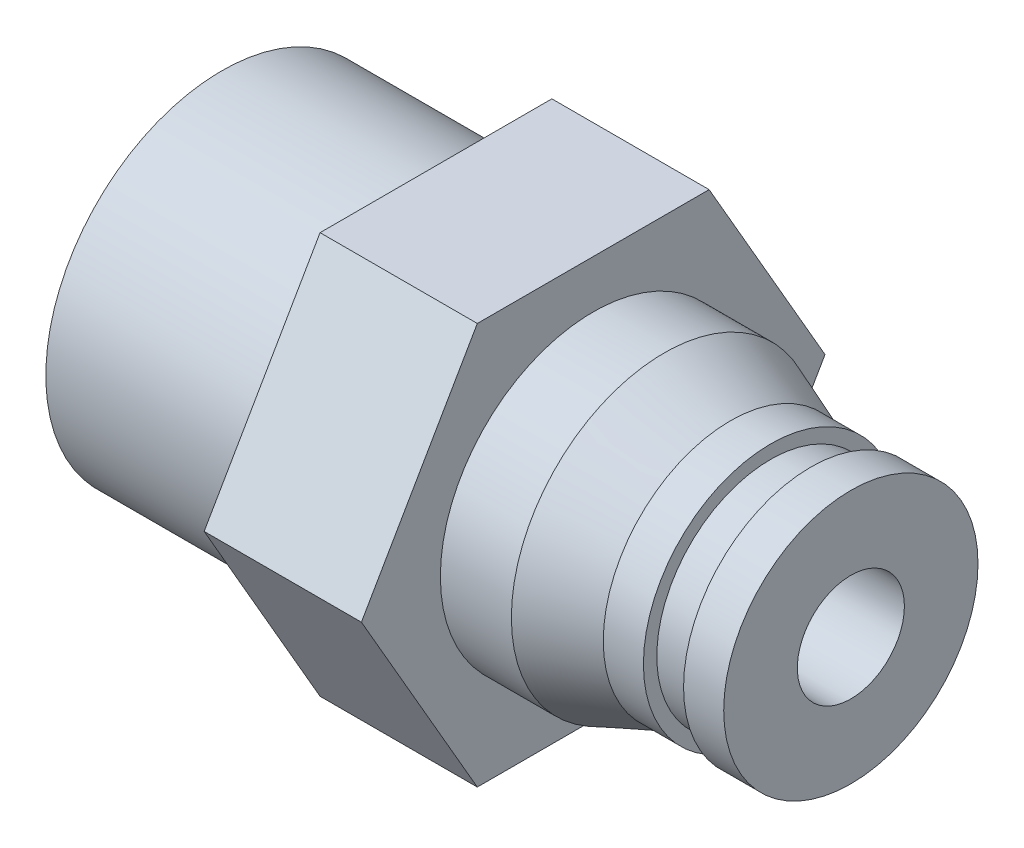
ISO-10303-21;
HEADER;
FILE_DESCRIPTION(('STEP AP214'),'2;1');
FILE_NAME('part.step','',(''),(''),'','','');
FILE_SCHEMA(('AUTOMOTIVE_DESIGN { 1 0 10303 214 1 1 1 1 }'));
ENDSEC;
DATA;
#1=APPLICATION_CONTEXT('core data for automotive mechanical design processes');
#2=APPLICATION_PROTOCOL_DEFINITION('international standard','automotive_design',2000,#1);
#3=PRODUCT_CONTEXT('',#1,'mechanical');
#4=PRODUCT('Part','Part','',(#3));
#5=PRODUCT_RELATED_PRODUCT_CATEGORY('part','',(#4));
#6=PRODUCT_DEFINITION_FORMATION('','',#4);
#7=PRODUCT_DEFINITION_CONTEXT('part definition',#1,'design');
#8=PRODUCT_DEFINITION('design','',#6,#7);
#9=PRODUCT_DEFINITION_SHAPE('','',#8);
#10=(LENGTH_UNIT() NAMED_UNIT(*) SI_UNIT(.MILLI.,.METRE.));
#11=(NAMED_UNIT(*) PLANE_ANGLE_UNIT() SI_UNIT($,.RADIAN.));
#12=(NAMED_UNIT(*) SI_UNIT($,.STERADIAN.) SOLID_ANGLE_UNIT());
#13=UNCERTAINTY_MEASURE_WITH_UNIT(LENGTH_MEASURE(1.E-05),#10,'distance_accuracy_value','');
#14=(GEOMETRIC_REPRESENTATION_CONTEXT(3) GLOBAL_UNCERTAINTY_ASSIGNED_CONTEXT((#13)) GLOBAL_UNIT_ASSIGNED_CONTEXT((#10,
#11,#12)) REPRESENTATION_CONTEXT('',''));
#15=CARTESIAN_POINT('',(0.,0.,0.));
#16=DIRECTION('',(0.,0.,1.));
#17=DIRECTION('',(1.,0.,0.));
#18=AXIS2_PLACEMENT_3D('',#15,#16,#17);
#19=CARTESIAN_POINT('',(8.,6.575,0.));
#20=DIRECTION('',(-1.,0.,0.));
#21=DIRECTION('',(0.,0.,1.));
#22=AXIS2_PLACEMENT_3D('',#19,#20,#21);
#23=PLANE('',#22);
#24=CARTESIAN_POINT('',(8.,0.,0.));
#25=DIRECTION('',(1.,0.,0.));
#26=DIRECTION('',(0.,0.,-1.));
#27=AXIS2_PLACEMENT_3D('',#24,#25,#26);
#28=CIRCLE('',#27,6.575);
#29=CARTESIAN_POINT('',(8.,0.,-6.575));
#30=VERTEX_POINT('',#29);
#31=EDGE_CURVE('E215',#30,#30,#28,.T.);
#32=ORIENTED_EDGE('',*,*,#31,.T.);
#33=EDGE_LOOP('',(#32));
#34=FACE_BOUND('',#33,.T.);
#35=DIRECTION('',(0.,-0.866025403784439,0.5));
#36=VECTOR('',#35,1.);
#37=CARTESIAN_POINT('',(8.,0.,-8.66025403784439));
#38=LINE('',#37,#36);
#39=CARTESIAN_POINT('',(8.,0.,-8.66025403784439));
#40=VERTEX_POINT('',#39);
#41=CARTESIAN_POINT('',(8.,-7.5,-4.33012701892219));
#42=VERTEX_POINT('',#41);
#43=EDGE_CURVE('E121',#40,#42,#38,.T.);
#44=ORIENTED_EDGE('',*,*,#43,.T.);
#45=DIRECTION('',(0.,0.,1.));
#46=VECTOR('',#45,1.);
#47=CARTESIAN_POINT('',(8.,-7.5,-4.33012701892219));
#48=LINE('',#47,#46);
#49=CARTESIAN_POINT('',(8.,-7.5,4.3301270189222));
#50=VERTEX_POINT('',#49);
#51=EDGE_CURVE('E106',#42,#50,#48,.T.);
#52=ORIENTED_EDGE('',*,*,#51,.T.);
#53=DIRECTION('',(0.,0.866025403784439,0.5));
#54=VECTOR('',#53,1.);
#55=CARTESIAN_POINT('',(8.,-7.5,4.3301270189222));
#56=LINE('',#55,#54);
#57=CARTESIAN_POINT('',(8.,0.,8.66025403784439));
#58=VERTEX_POINT('',#57);
#59=EDGE_CURVE('E115',#50,#58,#56,.T.);
#60=ORIENTED_EDGE('',*,*,#59,.T.);
#61=DIRECTION('',(0.,0.866025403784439,-0.5));
#62=VECTOR('',#61,1.);
#63=CARTESIAN_POINT('',(8.,0.,8.66025403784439));
#64=LINE('',#63,#62);
#65=CARTESIAN_POINT('',(8.,7.5,4.33012701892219));
#66=VERTEX_POINT('',#65);
#67=EDGE_CURVE('E30',#58,#66,#64,.T.);
#68=ORIENTED_EDGE('',*,*,#67,.T.);
#69=DIRECTION('',(0.,0.,-1.));
#70=VECTOR('',#69,1.);
#71=CARTESIAN_POINT('',(8.,7.5,4.33012701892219));
#72=LINE('',#71,#70);
#73=CARTESIAN_POINT('',(8.,7.5,-4.3301270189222));
#74=VERTEX_POINT('',#73);
#75=EDGE_CURVE('E125',#66,#74,#72,.T.);
#76=ORIENTED_EDGE('',*,*,#75,.T.);
#77=DIRECTION('',(0.,-0.866025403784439,-0.5));
#78=VECTOR('',#77,1.);
#79=CARTESIAN_POINT('',(8.,7.5,-4.3301270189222));
#80=LINE('',#79,#78);
#81=EDGE_CURVE('E128',#74,#40,#80,.T.);
#82=ORIENTED_EDGE('',*,*,#81,.T.);
#83=EDGE_LOOP('',(#44,#52,#60,#68,#76,#82));
#84=FACE_BOUND('',#83,.T.);
#85=ADVANCED_FACE('F15',(#34,#84),#23,.T.);
#86=CARTESIAN_POINT('',(13.875,9.5,0.));
#87=DIRECTION('',(1.,0.,0.));
#88=DIRECTION('',(0.,0.,-1.));
#89=AXIS2_PLACEMENT_3D('',#86,#87,#88);
#90=PLANE('',#89);
#91=CARTESIAN_POINT('',(13.875,0.,0.));
#92=DIRECTION('',(1.,0.,0.));
#93=DIRECTION('',(0.,0.,-1.));
#94=AXIS2_PLACEMENT_3D('',#91,#92,#93);
#95=CIRCLE('',#94,5.71042834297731);
#96=CARTESIAN_POINT('',(13.875,0.,-5.71042834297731));
#97=VERTEX_POINT('',#96);
#98=EDGE_CURVE('E212',#97,#97,#95,.T.);
#99=ORIENTED_EDGE('',*,*,#98,.F.);
#100=EDGE_LOOP('',(#99));
#101=FACE_BOUND('',#100,.T.);
#102=DIRECTION('',(0.,0.866025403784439,0.5));
#103=VECTOR('',#102,1.);
#104=CARTESIAN_POINT('',(13.875,-7.5,4.3301270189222));
#105=LINE('',#104,#103);
#106=CARTESIAN_POINT('',(13.875,-7.5,4.33012701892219));
#107=VERTEX_POINT('',#106);
#108=CARTESIAN_POINT('',(13.875,0.,8.66025403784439));
#109=VERTEX_POINT('',#108);
#110=EDGE_CURVE('E132',#107,#109,#105,.T.);
#111=ORIENTED_EDGE('',*,*,#110,.F.);
#112=DIRECTION('',(0.,0.,1.));
#113=VECTOR('',#112,1.);
#114=CARTESIAN_POINT('',(13.875,-7.5,-4.33012701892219));
#115=LINE('',#114,#113);
#116=CARTESIAN_POINT('',(13.875,-7.5,-4.33012701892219));
#117=VERTEX_POINT('',#116);
#118=EDGE_CURVE('E38',#117,#107,#115,.T.);
#119=ORIENTED_EDGE('',*,*,#118,.F.);
#120=DIRECTION('',(0.,-0.866025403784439,0.5));
#121=VECTOR('',#120,1.);
#122=CARTESIAN_POINT('',(13.875,0.,-8.66025403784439));
#123=LINE('',#122,#121);
#124=CARTESIAN_POINT('',(13.875,0.,-8.66025403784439));
#125=VERTEX_POINT('',#124);
#126=EDGE_CURVE('E112',#125,#117,#123,.T.);
#127=ORIENTED_EDGE('',*,*,#126,.F.);
#128=DIRECTION('',(0.,-0.866025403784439,-0.5));
#129=VECTOR('',#128,1.);
#130=CARTESIAN_POINT('',(13.875,7.5,-4.3301270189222));
#131=LINE('',#130,#129);
#132=CARTESIAN_POINT('',(13.875,7.5,-4.3301270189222));
#133=VERTEX_POINT('',#132);
#134=EDGE_CURVE('E140',#133,#125,#131,.T.);
#135=ORIENTED_EDGE('',*,*,#134,.F.);
#136=DIRECTION('',(0.,0.,-1.));
#137=VECTOR('',#136,1.);
#138=CARTESIAN_POINT('',(13.875,7.5,4.33012701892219));
#139=LINE('',#138,#137);
#140=CARTESIAN_POINT('',(13.875,7.5,4.33012701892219));
#141=VERTEX_POINT('',#140);
#142=EDGE_CURVE('E137',#141,#133,#139,.T.);
#143=ORIENTED_EDGE('',*,*,#142,.F.);
#144=DIRECTION('',(0.,0.866025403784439,-0.5));
#145=VECTOR('',#144,1.);
#146=CARTESIAN_POINT('',(13.875,0.,8.66025403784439));
#147=LINE('',#146,#145);
#148=EDGE_CURVE('E134',#109,#141,#147,.T.);
#149=ORIENTED_EDGE('',*,*,#148,.F.);
#150=EDGE_LOOP('',(#111,#119,#127,#135,#143,#149));
#151=FACE_BOUND('',#150,.T.);
#152=ADVANCED_FACE('F269',(#101,#151),#90,.T.);
#153=CARTESIAN_POINT('',(0.,0.,0.));
#154=DIRECTION('',(-1.,0.,0.));
#155=DIRECTION('',(0.,0.,1.));
#156=AXIS2_PLACEMENT_3D('',#153,#154,#155);
#157=PLANE('',#156);
#158=CARTESIAN_POINT('',(0.,0.,0.));
#159=DIRECTION('',(1.,0.,0.));
#160=DIRECTION('',(0.,0.,-1.));
#161=AXIS2_PLACEMENT_3D('',#158,#159,#160);
#162=CIRCLE('',#161,6.575);
#163=CARTESIAN_POINT('',(0.,0.,-6.575));
#164=VERTEX_POINT('',#163);
#165=EDGE_CURVE('E218',#164,#164,#162,.T.);
#166=ORIENTED_EDGE('',*,*,#165,.F.);
#167=EDGE_LOOP('',(#166));
#168=FACE_BOUND('',#167,.T.);
#169=DIRECTION('',(0.,-0.866025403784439,-0.5));
#170=VECTOR('',#169,1.);
#171=CARTESIAN_POINT('',(0.,0.,1.73205080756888));
#172=LINE('',#171,#170);
#173=CARTESIAN_POINT('',(0.,0.,1.73205080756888));
#174=VERTEX_POINT('',#173);
#175=CARTESIAN_POINT('',(0.,-1.5,0.866025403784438));
#176=VERTEX_POINT('',#175);
#177=EDGE_CURVE('E169',#174,#176,#172,.T.);
#178=ORIENTED_EDGE('',*,*,#177,.T.);
#179=DIRECTION('',(0.,0.,-1.));
#180=VECTOR('',#179,1.);
#181=CARTESIAN_POINT('',(0.,-1.5,0.866025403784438));
#182=LINE('',#181,#180);
#183=CARTESIAN_POINT('',(0.,-1.5,-0.866025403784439));
#184=VERTEX_POINT('',#183);
#185=EDGE_CURVE('E147',#176,#184,#182,.T.);
#186=ORIENTED_EDGE('',*,*,#185,.T.);
#187=DIRECTION('',(0.,0.866025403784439,-0.5));
#188=VECTOR('',#187,1.);
#189=CARTESIAN_POINT('',(0.,-1.5,-0.866025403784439));
#190=LINE('',#189,#188);
#191=CARTESIAN_POINT('',(0.,0.,-1.73205080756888));
#192=VERTEX_POINT('',#191);
#193=EDGE_CURVE('E157',#184,#192,#190,.T.);
#194=ORIENTED_EDGE('',*,*,#193,.T.);
#195=DIRECTION('',(0.,0.866025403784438,0.5));
#196=VECTOR('',#195,1.);
#197=CARTESIAN_POINT('',(0.,0.,-1.73205080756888));
#198=LINE('',#197,#196);
#199=CARTESIAN_POINT('',(0.,1.5,-0.866025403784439));
#200=VERTEX_POINT('',#199);
#201=EDGE_CURVE('E160',#192,#200,#198,.T.);
#202=ORIENTED_EDGE('',*,*,#201,.T.);
#203=DIRECTION('',(0.,0.,1.));
#204=VECTOR('',#203,1.);
#205=CARTESIAN_POINT('',(0.,1.5,-0.866025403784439));
#206=LINE('',#205,#204);
#207=CARTESIAN_POINT('',(0.,1.5,0.866025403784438));
#208=VERTEX_POINT('',#207);
#209=EDGE_CURVE('E163',#200,#208,#206,.T.);
#210=ORIENTED_EDGE('',*,*,#209,.T.);
#211=DIRECTION('',(0.,-0.866025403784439,0.5));
#212=VECTOR('',#211,1.);
#213=CARTESIAN_POINT('',(0.,1.5,0.866025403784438));
#214=LINE('',#213,#212);
#215=EDGE_CURVE('E166',#208,#174,#214,.T.);
#216=ORIENTED_EDGE('',*,*,#215,.T.);
#217=EDGE_LOOP('',(#178,#186,#194,#202,#210,#216));
#218=FACE_BOUND('',#217,.T.);
#219=ADVANCED_FACE('F17',(#168,#218),#157,.T.);
#220=CARTESIAN_POINT('',(7.5,2.,0.));
#221=DIRECTION('',(1.,0.,0.));
#222=DIRECTION('',(0.,0.,-1.));
#223=AXIS2_PLACEMENT_3D('',#220,#221,#222);
#224=PLANE('',#223);
#225=CARTESIAN_POINT('',(7.5,0.,0.));
#226=DIRECTION('',(1.,0.,0.));
#227=DIRECTION('',(0.,0.,-1.));
#228=AXIS2_PLACEMENT_3D('',#225,#226,#227);
#229=CIRCLE('',#228,2.);
#230=CARTESIAN_POINT('',(7.5,0.,-2.));
#231=VERTEX_POINT('',#230);
#232=EDGE_CURVE('E185',#231,#231,#229,.T.);
#233=ORIENTED_EDGE('',*,*,#232,.T.);
#234=EDGE_LOOP('',(#233));
#235=FACE_BOUND('',#234,.T.);
#236=DIRECTION('',(0.,-0.866025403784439,0.5));
#237=VECTOR('',#236,1.);
#238=CARTESIAN_POINT('',(7.5,0.75,-2.1650635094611));
#239=LINE('',#238,#237);
#240=CARTESIAN_POINT('',(7.5,0.,-1.73205080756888));
#241=VERTEX_POINT('',#240);
#242=CARTESIAN_POINT('',(7.5,-1.5,-0.866025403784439));
#243=VERTEX_POINT('',#242);
#244=EDGE_CURVE('E23',#241,#243,#239,.T.);
#245=ORIENTED_EDGE('',*,*,#244,.T.);
#246=DIRECTION('',(0.,0.,1.));
#247=VECTOR('',#246,1.);
#248=CARTESIAN_POINT('',(7.5,-1.5,0.));
#249=LINE('',#248,#247);
#250=CARTESIAN_POINT('',(7.5,-1.5,0.866025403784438));
#251=VERTEX_POINT('',#250);
#252=EDGE_CURVE('E10',#243,#251,#249,.T.);
#253=ORIENTED_EDGE('',*,*,#252,.T.);
#254=DIRECTION('',(0.,0.866025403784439,0.5));
#255=VECTOR('',#254,1.);
#256=CARTESIAN_POINT('',(7.5,0.75,2.1650635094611));
#257=LINE('',#256,#255);
#258=CARTESIAN_POINT('',(7.5,0.,1.73205080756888));
#259=VERTEX_POINT('',#258);
#260=EDGE_CURVE('E221',#251,#259,#257,.T.);
#261=ORIENTED_EDGE('',*,*,#260,.T.);
#262=DIRECTION('',(0.,0.866025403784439,-0.5));
#263=VECTOR('',#262,1.);
#264=CARTESIAN_POINT('',(7.5,2.25,0.433012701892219));
#265=LINE('',#264,#263);
#266=CARTESIAN_POINT('',(7.5,1.5,0.866025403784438));
#267=VERTEX_POINT('',#266);
#268=EDGE_CURVE('E224',#259,#267,#265,.T.);
#269=ORIENTED_EDGE('',*,*,#268,.T.);
#270=DIRECTION('',(0.,0.,-1.));
#271=VECTOR('',#270,1.);
#272=CARTESIAN_POINT('',(7.5,1.5,0.));
#273=LINE('',#272,#271);
#274=CARTESIAN_POINT('',(7.5,1.5,-0.866025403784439));
#275=VERTEX_POINT('',#274);
#276=EDGE_CURVE('E227',#267,#275,#273,.T.);
#277=ORIENTED_EDGE('',*,*,#276,.T.);
#278=DIRECTION('',(0.,-0.866025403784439,-0.5));
#279=VECTOR('',#278,1.);
#280=CARTESIAN_POINT('',(7.5,2.25,-0.433012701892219));
#281=LINE('',#280,#279);
#282=EDGE_CURVE('E230',#275,#241,#281,.T.);
#283=ORIENTED_EDGE('',*,*,#282,.T.);
#284=EDGE_LOOP('',(#245,#253,#261,#269,#277,#283));
#285=FACE_BOUND('',#284,.T.);
#286=ADVANCED_FACE('F234',(#235,#285),#224,.T.);
#287=CARTESIAN_POINT('',(0.,0.,0.));
#288=DIRECTION('',(1.,0.,0.));
#289=DIRECTION('',(0.,0.,-1.));
#290=AXIS2_PLACEMENT_3D('',#287,#288,#289);
#291=CYLINDRICAL_SURFACE('',#290,6.575);
#292=ORIENTED_EDGE('',*,*,#165,.T.);
#293=EDGE_LOOP('',(#292));
#294=FACE_BOUND('',#293,.T.);
#295=ORIENTED_EDGE('',*,*,#31,.F.);
#296=EDGE_LOOP('',(#295));
#297=FACE_BOUND('',#296,.T.);
#298=ADVANCED_FACE('F278',(#294,#297),#291,.T.);
#299=CARTESIAN_POINT('',(0.,0.,0.));
#300=DIRECTION('',(1.,0.,0.));
#301=DIRECTION('',(0.,0.,-1.));
#302=AXIS2_PLACEMENT_3D('',#299,#300,#301);
#303=CYLINDRICAL_SURFACE('',#302,5.71042834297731);
#304=ORIENTED_EDGE('',*,*,#98,.T.);
#305=EDGE_LOOP('',(#304));
#306=FACE_BOUND('',#305,.T.);
#307=CARTESIAN_POINT('',(16.527492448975,0.,0.));
#308=DIRECTION('',(1.,0.,0.));
#309=DIRECTION('',(0.,0.,-1.));
#310=AXIS2_PLACEMENT_3D('',#307,#308,#309);
#311=CIRCLE('',#310,5.71042834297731);
#312=CARTESIAN_POINT('',(16.527492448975,0.,-5.71042834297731));
#313=VERTEX_POINT('',#312);
#314=EDGE_CURVE('E209',#313,#313,#311,.T.);
#315=ORIENTED_EDGE('',*,*,#314,.F.);
#316=EDGE_LOOP('',(#315));
#317=FACE_BOUND('',#316,.T.);
#318=ADVANCED_FACE('F280',(#306,#317),#303,.T.);
#319=CARTESIAN_POINT('',(19.,0.,0.));
#320=DIRECTION('',(-1.,0.,0.));
#321=DIRECTION('',(0.,0.,1.));
#322=AXIS2_PLACEMENT_3D('',#319,#320,#321);
#323=CONICAL_SURFACE('',#322,4.75,0.370503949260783);
#324=ORIENTED_EDGE('',*,*,#314,.T.);
#325=EDGE_LOOP('',(#324));
#326=FACE_BOUND('',#325,.T.);
#327=CARTESIAN_POINT('',(19.,0.,0.));
#328=DIRECTION('',(1.,0.,0.));
#329=DIRECTION('',(0.,0.,-1.));
#330=AXIS2_PLACEMENT_3D('',#327,#328,#329);
#331=CIRCLE('',#330,4.75);
#332=CARTESIAN_POINT('',(19.,0.,-4.75));
#333=VERTEX_POINT('',#332);
#334=EDGE_CURVE('E206',#333,#333,#331,.T.);
#335=ORIENTED_EDGE('',*,*,#334,.F.);
#336=EDGE_LOOP('',(#335));
#337=FACE_BOUND('',#336,.T.);
#338=ADVANCED_FACE('F286',(#326,#337),#323,.T.);
#339=CARTESIAN_POINT('',(0.,0.,0.));
#340=DIRECTION('',(1.,0.,0.));
#341=DIRECTION('',(0.,0.,-1.));
#342=AXIS2_PLACEMENT_3D('',#339,#340,#341);
#343=CYLINDRICAL_SURFACE('',#342,4.75);
#344=ORIENTED_EDGE('',*,*,#334,.T.);
#345=EDGE_LOOP('',(#344));
#346=FACE_BOUND('',#345,.T.);
#347=CARTESIAN_POINT('',(20.5,0.,0.));
#348=DIRECTION('',(1.,0.,0.));
#349=DIRECTION('',(0.,0.,-1.));
#350=AXIS2_PLACEMENT_3D('',#347,#348,#349);
#351=CIRCLE('',#350,4.75);
#352=CARTESIAN_POINT('',(20.5,0.,-4.75));
#353=VERTEX_POINT('',#352);
#354=EDGE_CURVE('E203',#353,#353,#351,.T.);
#355=ORIENTED_EDGE('',*,*,#354,.F.);
#356=EDGE_LOOP('',(#355));
#357=FACE_BOUND('',#356,.T.);
#358=ADVANCED_FACE('F330',(#346,#357),#343,.T.);
#359=CARTESIAN_POINT('',(20.5,4.75,0.));
#360=DIRECTION('',(1.,0.,0.));
#361=DIRECTION('',(0.,0.,-1.));
#362=AXIS2_PLACEMENT_3D('',#359,#360,#361);
#363=PLANE('',#362);
#364=ORIENTED_EDGE('',*,*,#354,.T.);
#365=EDGE_LOOP('',(#364));
#366=FACE_BOUND('',#365,.T.);
#367=CARTESIAN_POINT('',(20.5,0.,0.));
#368=DIRECTION('',(1.,0.,0.));
#369=DIRECTION('',(0.,0.,-1.));
#370=AXIS2_PLACEMENT_3D('',#367,#368,#369);
#371=CIRCLE('',#370,4.25);
#372=CARTESIAN_POINT('',(20.5,0.,-4.25));
#373=VERTEX_POINT('',#372);
#374=EDGE_CURVE('E200',#373,#373,#371,.T.);
#375=ORIENTED_EDGE('',*,*,#374,.F.);
#376=EDGE_LOOP('',(#375));
#377=FACE_BOUND('',#376,.T.);
#378=ADVANCED_FACE('F340',(#366,#377),#363,.T.);
#379=CARTESIAN_POINT('',(0.,0.,0.));
#380=DIRECTION('',(1.,0.,0.));
#381=DIRECTION('',(0.,0.,-1.));
#382=AXIS2_PLACEMENT_3D('',#379,#380,#381);
#383=CYLINDRICAL_SURFACE('',#382,4.25);
#384=ORIENTED_EDGE('',*,*,#374,.T.);
#385=EDGE_LOOP('',(#384));
#386=FACE_BOUND('',#385,.T.);
#387=CARTESIAN_POINT('',(22.,0.,0.));
#388=DIRECTION('',(1.,0.,0.));
#389=DIRECTION('',(0.,0.,-1.));
#390=AXIS2_PLACEMENT_3D('',#387,#388,#389);
#391=CIRCLE('',#390,4.25);
#392=CARTESIAN_POINT('',(22.,0.,-4.25));
#393=VERTEX_POINT('',#392);
#394=EDGE_CURVE('E197',#393,#393,#391,.T.);
#395=ORIENTED_EDGE('',*,*,#394,.F.);
#396=EDGE_LOOP('',(#395));
#397=FACE_BOUND('',#396,.T.);
#398=ADVANCED_FACE('F350',(#386,#397),#383,.T.);
#399=CARTESIAN_POINT('',(22.,4.25,0.));
#400=DIRECTION('',(-1.,0.,0.));
#401=DIRECTION('',(0.,0.,1.));
#402=AXIS2_PLACEMENT_3D('',#399,#400,#401);
#403=PLANE('',#402);
#404=ORIENTED_EDGE('',*,*,#394,.T.);
#405=EDGE_LOOP('',(#404));
#406=FACE_BOUND('',#405,.T.);
#407=CARTESIAN_POINT('',(22.,0.,0.));
#408=DIRECTION('',(1.,0.,0.));
#409=DIRECTION('',(0.,0.,-1.));
#410=AXIS2_PLACEMENT_3D('',#407,#408,#409);
#411=CIRCLE('',#410,4.75);
#412=CARTESIAN_POINT('',(22.,0.,-4.75));
#413=VERTEX_POINT('',#412);
#414=EDGE_CURVE('E194',#413,#413,#411,.T.);
#415=ORIENTED_EDGE('',*,*,#414,.F.);
#416=EDGE_LOOP('',(#415));
#417=FACE_BOUND('',#416,.T.);
#418=ADVANCED_FACE('F361',(#406,#417),#403,.T.);
#419=CARTESIAN_POINT('',(0.,0.,0.));
#420=DIRECTION('',(1.,0.,0.));
#421=DIRECTION('',(0.,0.,-1.));
#422=AXIS2_PLACEMENT_3D('',#419,#420,#421);
#423=CYLINDRICAL_SURFACE('',#422,4.75);
#424=ORIENTED_EDGE('',*,*,#414,.T.);
#425=EDGE_LOOP('',(#424));
#426=FACE_BOUND('',#425,.T.);
#427=CARTESIAN_POINT('',(23.5,0.,0.));
#428=DIRECTION('',(1.,0.,0.));
#429=DIRECTION('',(0.,0.,-1.));
#430=AXIS2_PLACEMENT_3D('',#427,#428,#429);
#431=CIRCLE('',#430,4.75);
#432=CARTESIAN_POINT('',(23.5,0.,-4.75));
#433=VERTEX_POINT('',#432);
#434=EDGE_CURVE('E191',#433,#433,#431,.T.);
#435=ORIENTED_EDGE('',*,*,#434,.F.);
#436=EDGE_LOOP('',(#435));
#437=FACE_BOUND('',#436,.T.);
#438=ADVANCED_FACE('F374',(#426,#437),#423,.T.);
#439=CARTESIAN_POINT('',(23.5,4.75,0.));
#440=DIRECTION('',(1.,0.,0.));
#441=DIRECTION('',(0.,0.,-1.));
#442=AXIS2_PLACEMENT_3D('',#439,#440,#441);
#443=PLANE('',#442);
#444=ORIENTED_EDGE('',*,*,#434,.T.);
#445=EDGE_LOOP('',(#444));
#446=FACE_BOUND('',#445,.T.);
#447=CARTESIAN_POINT('',(23.5,0.,0.));
#448=DIRECTION('',(1.,0.,0.));
#449=DIRECTION('',(0.,0.,-1.));
#450=AXIS2_PLACEMENT_3D('',#447,#448,#449);
#451=CIRCLE('',#450,2.);
#452=CARTESIAN_POINT('',(23.5,0.,-2.));
#453=VERTEX_POINT('',#452);
#454=EDGE_CURVE('E188',#453,#453,#451,.T.);
#455=ORIENTED_EDGE('',*,*,#454,.F.);
#456=EDGE_LOOP('',(#455));
#457=FACE_BOUND('',#456,.T.);
#458=ADVANCED_FACE('F385',(#446,#457),#443,.T.);
#459=CARTESIAN_POINT('',(0.,0.,0.));
#460=DIRECTION('',(1.,0.,0.));
#461=DIRECTION('',(0.,0.,-1.));
#462=AXIS2_PLACEMENT_3D('',#459,#460,#461);
#463=CYLINDRICAL_SURFACE('',#462,2.);
#464=ORIENTED_EDGE('',*,*,#454,.T.);
#465=EDGE_LOOP('',(#464));
#466=FACE_BOUND('',#465,.T.);
#467=ORIENTED_EDGE('',*,*,#232,.F.);
#468=EDGE_LOOP('',(#467));
#469=FACE_BOUND('',#468,.T.);
#470=ADVANCED_FACE('F397',(#466,#469),#463,.F.);
#471=CARTESIAN_POINT('',(23.5,-1.5,0.866025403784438));
#472=DIRECTION('',(0.,1.,0.));
#473=DIRECTION('',(0.,0.,1.));
#474=AXIS2_PLACEMENT_3D('',#471,#472,#473);
#475=PLANE('',#474);
#476=DIRECTION('',(-1.,0.,0.));
#477=VECTOR('',#476,1.);
#478=CARTESIAN_POINT('',(23.5,-1.5,-0.866025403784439));
#479=LINE('',#478,#477);
#480=EDGE_CURVE('E183',#243,#184,#479,.T.);
#481=ORIENTED_EDGE('',*,*,#480,.T.);
#482=ORIENTED_EDGE('',*,*,#185,.F.);
#483=DIRECTION('',(-1.,0.,0.));
#484=VECTOR('',#483,1.);
#485=CARTESIAN_POINT('',(23.5,-1.5,0.866025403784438));
#486=LINE('',#485,#484);
#487=EDGE_CURVE('E172',#251,#176,#486,.T.);
#488=ORIENTED_EDGE('',*,*,#487,.F.);
#489=ORIENTED_EDGE('',*,*,#252,.F.);
#490=EDGE_LOOP('',(#481,#482,#488,#489));
#491=FACE_BOUND('',#490,.T.);
#492=ADVANCED_FACE('F249',(#491),#475,.T.);
#493=CARTESIAN_POINT('',(23.5,-1.5,-0.866025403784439));
#494=DIRECTION('',(0.,0.5,0.866025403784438));
#495=DIRECTION('',(0.,-0.866025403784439,0.5));
#496=AXIS2_PLACEMENT_3D('',#493,#494,#495);
#497=PLANE('',#496);
#498=DIRECTION('',(-1.,0.,0.));
#499=VECTOR('',#498,1.);
#500=CARTESIAN_POINT('',(23.5,0.,-1.73205080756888));
#501=LINE('',#500,#499);
#502=EDGE_CURVE('E181',#241,#192,#501,.T.);
#503=ORIENTED_EDGE('',*,*,#502,.T.);
#504=ORIENTED_EDGE('',*,*,#193,.F.);
#505=ORIENTED_EDGE('',*,*,#480,.F.);
#506=ORIENTED_EDGE('',*,*,#244,.F.);
#507=EDGE_LOOP('',(#503,#504,#505,#506));
#508=FACE_BOUND('',#507,.T.);
#509=ADVANCED_FACE('F238',(#508),#497,.T.);
#510=CARTESIAN_POINT('',(23.5,0.,-1.73205080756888));
#511=DIRECTION('',(0.,-0.5,0.866025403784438));
#512=DIRECTION('',(0.,-0.866025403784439,-0.5));
#513=AXIS2_PLACEMENT_3D('',#510,#511,#512);
#514=PLANE('',#513);
#515=DIRECTION('',(-1.,0.,0.));
#516=VECTOR('',#515,1.);
#517=CARTESIAN_POINT('',(23.5,1.5,-0.866025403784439));
#518=LINE('',#517,#516);
#519=EDGE_CURVE('E179',#275,#200,#518,.T.);
#520=ORIENTED_EDGE('',*,*,#519,.T.);
#521=ORIENTED_EDGE('',*,*,#201,.F.);
#522=ORIENTED_EDGE('',*,*,#502,.F.);
#523=ORIENTED_EDGE('',*,*,#282,.F.);
#524=EDGE_LOOP('',(#520,#521,#522,#523));
#525=FACE_BOUND('',#524,.T.);
#526=ADVANCED_FACE('F242',(#525),#514,.T.);
#527=CARTESIAN_POINT('',(23.5,1.5,-0.866025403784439));
#528=DIRECTION('',(0.,-1.,0.));
#529=DIRECTION('',(0.,0.,-1.));
#530=AXIS2_PLACEMENT_3D('',#527,#528,#529);
#531=PLANE('',#530);
#532=DIRECTION('',(-1.,0.,0.));
#533=VECTOR('',#532,1.);
#534=CARTESIAN_POINT('',(23.5,1.5,0.866025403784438));
#535=LINE('',#534,#533);
#536=EDGE_CURVE('E177',#267,#208,#535,.T.);
#537=ORIENTED_EDGE('',*,*,#536,.T.);
#538=ORIENTED_EDGE('',*,*,#209,.F.);
#539=ORIENTED_EDGE('',*,*,#519,.F.);
#540=ORIENTED_EDGE('',*,*,#276,.F.);
#541=EDGE_LOOP('',(#537,#538,#539,#540));
#542=FACE_BOUND('',#541,.T.);
#543=ADVANCED_FACE('F258',(#542),#531,.T.);
#544=CARTESIAN_POINT('',(23.5,1.5,0.866025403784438));
#545=DIRECTION('',(0.,-0.5,-0.866025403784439));
#546=DIRECTION('',(0.,0.866025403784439,-0.5));
#547=AXIS2_PLACEMENT_3D('',#544,#545,#546);
#548=PLANE('',#547);
#549=DIRECTION('',(-1.,0.,0.));
#550=VECTOR('',#549,1.);
#551=CARTESIAN_POINT('',(23.5,0.,1.73205080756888));
#552=LINE('',#551,#550);
#553=EDGE_CURVE('E175',#259,#174,#552,.T.);
#554=ORIENTED_EDGE('',*,*,#553,.T.);
#555=ORIENTED_EDGE('',*,*,#215,.F.);
#556=ORIENTED_EDGE('',*,*,#536,.F.);
#557=ORIENTED_EDGE('',*,*,#268,.F.);
#558=EDGE_LOOP('',(#554,#555,#556,#557));
#559=FACE_BOUND('',#558,.T.);
#560=ADVANCED_FACE('F255',(#559),#548,.T.);
#561=CARTESIAN_POINT('',(23.5,0.,1.73205080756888));
#562=DIRECTION('',(0.,0.5,-0.866025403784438));
#563=DIRECTION('',(0.,0.866025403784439,0.5));
#564=AXIS2_PLACEMENT_3D('',#561,#562,#563);
#565=PLANE('',#564);
#566=ORIENTED_EDGE('',*,*,#487,.T.);
#567=ORIENTED_EDGE('',*,*,#177,.F.);
#568=ORIENTED_EDGE('',*,*,#553,.F.);
#569=ORIENTED_EDGE('',*,*,#260,.F.);
#570=EDGE_LOOP('',(#566,#567,#568,#569));
#571=FACE_BOUND('',#570,.T.);
#572=ADVANCED_FACE('F251',(#571),#565,.T.);
#573=CARTESIAN_POINT('',(13.875,-7.5,-4.33012701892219));
#574=DIRECTION('',(0.,-1.,0.));
#575=DIRECTION('',(0.,0.,-1.));
#576=AXIS2_PLACEMENT_3D('',#573,#574,#575);
#577=PLANE('',#576);
#578=DIRECTION('',(-1.,0.,0.));
#579=VECTOR('',#578,1.);
#580=CARTESIAN_POINT('',(13.875,-7.5,-4.33012701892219));
#581=LINE('',#580,#579);
#582=EDGE_CURVE('E145',#117,#42,#581,.T.);
#583=ORIENTED_EDGE('',*,*,#582,.F.);
#584=ORIENTED_EDGE('',*,*,#118,.T.);
#585=DIRECTION('',(-1.,0.,0.));
#586=VECTOR('',#585,1.);
#587=CARTESIAN_POINT('',(13.875,-7.5,4.3301270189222));
#588=LINE('',#587,#586);
#589=EDGE_CURVE('E102',#107,#50,#588,.T.);
#590=ORIENTED_EDGE('',*,*,#589,.T.);
#591=ORIENTED_EDGE('',*,*,#51,.F.);
#592=EDGE_LOOP('',(#583,#584,#590,#591));
#593=FACE_BOUND('',#592,.T.);
#594=ADVANCED_FACE('F104',(#593),#577,.T.);
#595=CARTESIAN_POINT('',(13.875,0.,-8.66025403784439));
#596=DIRECTION('',(0.,-0.5,-0.866025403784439));
#597=DIRECTION('',(0.,0.866025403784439,-0.5));
#598=AXIS2_PLACEMENT_3D('',#595,#596,#597);
#599=PLANE('',#598);
#600=DIRECTION('',(-1.,0.,0.));
#601=VECTOR('',#600,1.);
#602=CARTESIAN_POINT('',(13.875,0.,-8.66025403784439));
#603=LINE('',#602,#601);
#604=EDGE_CURVE('E148',#125,#40,#603,.T.);
#605=ORIENTED_EDGE('',*,*,#604,.F.);
#606=ORIENTED_EDGE('',*,*,#126,.T.);
#607=ORIENTED_EDGE('',*,*,#582,.T.);
#608=ORIENTED_EDGE('',*,*,#43,.F.);
#609=EDGE_LOOP('',(#605,#606,#607,#608));
#610=FACE_BOUND('',#609,.T.);
#611=ADVANCED_FACE('F458',(#610),#599,.T.);
#612=CARTESIAN_POINT('',(13.875,7.5,-4.3301270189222));
#613=DIRECTION('',(0.,0.5,-0.866025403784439));
#614=DIRECTION('',(0.,0.866025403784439,0.5));
#615=AXIS2_PLACEMENT_3D('',#612,#613,#614);
#616=PLANE('',#615);
#617=DIRECTION('',(-1.,0.,0.));
#618=VECTOR('',#617,1.);
#619=CARTESIAN_POINT('',(13.875,7.5,-4.3301270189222));
#620=LINE('',#619,#618);
#621=EDGE_CURVE('E150',#133,#74,#620,.T.);
#622=ORIENTED_EDGE('',*,*,#621,.F.);
#623=ORIENTED_EDGE('',*,*,#134,.T.);
#624=ORIENTED_EDGE('',*,*,#604,.T.);
#625=ORIENTED_EDGE('',*,*,#81,.F.);
#626=EDGE_LOOP('',(#622,#623,#624,#625));
#627=FACE_BOUND('',#626,.T.);
#628=ADVANCED_FACE('F467',(#627),#616,.T.);
#629=CARTESIAN_POINT('',(13.875,7.5,4.33012701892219));
#630=DIRECTION('',(0.,1.,0.));
#631=DIRECTION('',(0.,0.,1.));
#632=AXIS2_PLACEMENT_3D('',#629,#630,#631);
#633=PLANE('',#632);
#634=DIRECTION('',(-1.,0.,0.));
#635=VECTOR('',#634,1.);
#636=CARTESIAN_POINT('',(13.875,7.5,4.33012701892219));
#637=LINE('',#636,#635);
#638=EDGE_CURVE('E152',#141,#66,#637,.T.);
#639=ORIENTED_EDGE('',*,*,#638,.F.);
#640=ORIENTED_EDGE('',*,*,#142,.T.);
#641=ORIENTED_EDGE('',*,*,#621,.T.);
#642=ORIENTED_EDGE('',*,*,#75,.F.);
#643=EDGE_LOOP('',(#639,#640,#641,#642));
#644=FACE_BOUND('',#643,.T.);
#645=ADVANCED_FACE('F477',(#644),#633,.T.);
#646=CARTESIAN_POINT('',(13.875,0.,8.66025403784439));
#647=DIRECTION('',(0.,0.5,0.866025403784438));
#648=DIRECTION('',(0.,-0.866025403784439,0.5));
#649=AXIS2_PLACEMENT_3D('',#646,#647,#648);
#650=PLANE('',#649);
#651=DIRECTION('',(-1.,0.,0.));
#652=VECTOR('',#651,1.);
#653=CARTESIAN_POINT('',(13.875,0.,8.66025403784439));
#654=LINE('',#653,#652);
#655=EDGE_CURVE('E111',#109,#58,#654,.T.);
#656=ORIENTED_EDGE('',*,*,#655,.F.);
#657=ORIENTED_EDGE('',*,*,#148,.T.);
#658=ORIENTED_EDGE('',*,*,#638,.T.);
#659=ORIENTED_EDGE('',*,*,#67,.F.);
#660=EDGE_LOOP('',(#656,#657,#658,#659));
#661=FACE_BOUND('',#660,.T.);
#662=ADVANCED_FACE('F487',(#661),#650,.T.);
#663=CARTESIAN_POINT('',(13.875,-7.5,4.3301270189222));
#664=DIRECTION('',(0.,-0.5,0.866025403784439));
#665=DIRECTION('',(0.,-0.866025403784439,-0.5));
#666=AXIS2_PLACEMENT_3D('',#663,#664,#665);
#667=PLANE('',#666);
#668=ORIENTED_EDGE('',*,*,#589,.F.);
#669=ORIENTED_EDGE('',*,*,#110,.T.);
#670=ORIENTED_EDGE('',*,*,#655,.T.);
#671=ORIENTED_EDGE('',*,*,#59,.F.);
#672=EDGE_LOOP('',(#668,#669,#670,#671));
#673=FACE_BOUND('',#672,.T.);
#674=ADVANCED_FACE('F116',(#673),#667,.T.);
#675=CLOSED_SHELL('',(#85,#152,#219,#286,#298,#318,#338,#358,#378,#398,#418,#438,#458,#470,#492,
#509,#526,#543,#560,#572,#594,#611,#628,#645,#662,#674));
#676=MANIFOLD_SOLID_BREP('B1',#675);
#677=ADVANCED_BREP_SHAPE_REPRESENTATION('',(#18,#676),#14);
#678=SHAPE_DEFINITION_REPRESENTATION(#9,#677);
ENDSEC;
END-ISO-10303-21;
